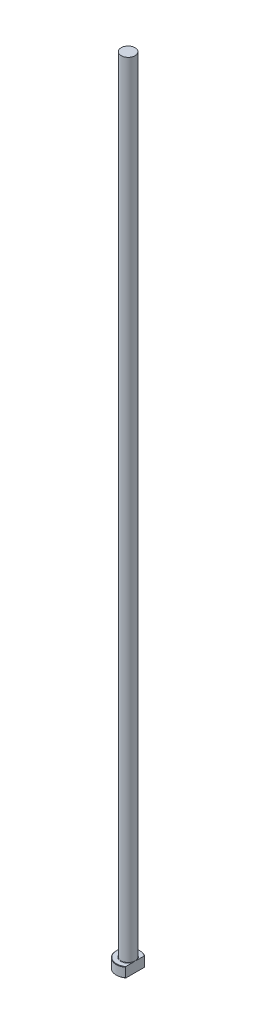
ISO-10303-21;
HEADER;
FILE_DESCRIPTION(('STEP AP214'),'2;1');
FILE_NAME('part.step','',(''),(''),'','','');
FILE_SCHEMA(('AUTOMOTIVE_DESIGN { 1 0 10303 214 1 1 1 1 }'));
ENDSEC;
DATA;
#1=APPLICATION_CONTEXT('core data for automotive mechanical design processes');
#2=APPLICATION_PROTOCOL_DEFINITION('international standard','automotive_design',2000,#1);
#3=PRODUCT_CONTEXT('',#1,'mechanical');
#4=PRODUCT('Part','Part','',(#3));
#5=PRODUCT_RELATED_PRODUCT_CATEGORY('part','',(#4));
#6=PRODUCT_DEFINITION_FORMATION('','',#4);
#7=PRODUCT_DEFINITION_CONTEXT('part definition',#1,'design');
#8=PRODUCT_DEFINITION('design','',#6,#7);
#9=PRODUCT_DEFINITION_SHAPE('','',#8);
#10=(LENGTH_UNIT() NAMED_UNIT(*) SI_UNIT(.MILLI.,.METRE.));
#11=(NAMED_UNIT(*) PLANE_ANGLE_UNIT() SI_UNIT($,.RADIAN.));
#12=(NAMED_UNIT(*) SI_UNIT($,.STERADIAN.) SOLID_ANGLE_UNIT());
#13=UNCERTAINTY_MEASURE_WITH_UNIT(LENGTH_MEASURE(1.E-05),#10,'distance_accuracy_value','');
#14=(GEOMETRIC_REPRESENTATION_CONTEXT(3) GLOBAL_UNCERTAINTY_ASSIGNED_CONTEXT((#13)) GLOBAL_UNIT_ASSIGNED_CONTEXT((#10,
#11,#12)) REPRESENTATION_CONTEXT('',''));
#15=CARTESIAN_POINT('',(0.,0.,0.));
#16=DIRECTION('',(0.,0.,1.));
#17=DIRECTION('',(1.,0.,0.));
#18=AXIS2_PLACEMENT_3D('',#15,#16,#17);
#19=CARTESIAN_POINT('',(0.,0.,0.));
#20=DIRECTION('',(0.,-1.,0.));
#21=DIRECTION('',(0.,0.,-1.));
#22=AXIS2_PLACEMENT_3D('',#19,#20,#21);
#23=PLANE('',#22);
#24=CARTESIAN_POINT('',(0.,0.,0.));
#25=DIRECTION('',(0.,-1.,0.));
#26=DIRECTION('',(0.,0.,-1.));
#27=AXIS2_PLACEMENT_3D('',#24,#25,#26);
#28=CIRCLE('',#27,5.79999999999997);
#29=CARTESIAN_POINT('',(3.49999999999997,0.,4.62493243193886));
#30=VERTEX_POINT('',#29);
#31=CARTESIAN_POINT('',(3.49999999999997,0.,-4.62493243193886));
#32=VERTEX_POINT('',#31);
#33=EDGE_CURVE('E98',#30,#32,#28,.T.);
#34=ORIENTED_EDGE('',*,*,#33,.T.);
#35=DIRECTION('',(0.,0.,1.));
#36=VECTOR('',#35,1.);
#37=CARTESIAN_POINT('',(3.49999999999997,0.,-4.87339717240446));
#38=LINE('',#37,#36);
#39=EDGE_CURVE('E83',#32,#30,#38,.T.);
#40=ORIENTED_EDGE('',*,*,#39,.T.);
#41=EDGE_LOOP('',(#34,#40));
#42=FACE_BOUND('',#41,.T.);
#43=ADVANCED_FACE('F32',(#42),#23,.T.);
#44=CARTESIAN_POINT('',(0.,259.958771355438,0.));
#45=DIRECTION('',(0.,1.,0.));
#46=DIRECTION('',(0.,0.,1.));
#47=AXIS2_PLACEMENT_3D('',#44,#45,#46);
#48=CYLINDRICAL_SURFACE('',#47,5.99999999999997);
#49=CARTESIAN_POINT('',(0.,4.80000000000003,0.));
#50=DIRECTION('',(0.,1.,0.));
#51=DIRECTION('',(0.,0.,1.));
#52=AXIS2_PLACEMENT_3D('',#49,#50,#51);
#53=CIRCLE('',#52,5.99999999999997);
#54=CARTESIAN_POINT('',(3.49999999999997,4.80000000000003,4.87339717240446));
#55=VERTEX_POINT('',#54);
#56=CARTESIAN_POINT('',(3.49999999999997,4.80000000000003,-4.87339717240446));
#57=VERTEX_POINT('',#56);
#58=EDGE_CURVE('E104',#55,#57,#53,.F.);
#59=ORIENTED_EDGE('',*,*,#58,.T.);
#60=DIRECTION('',(0.,-1.,0.));
#61=VECTOR('',#60,1.);
#62=CARTESIAN_POINT('',(3.49999999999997,400.,-4.87339717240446));
#63=LINE('',#62,#61);
#64=CARTESIAN_POINT('',(3.49999999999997,0.199999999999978,-4.87339717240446));
#65=VERTEX_POINT('',#64);
#66=EDGE_CURVE('E183',#57,#65,#63,.T.);
#67=ORIENTED_EDGE('',*,*,#66,.T.);
#68=CARTESIAN_POINT('',(0.,0.199999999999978,0.));
#69=DIRECTION('',(0.,-1.,0.));
#70=DIRECTION('',(0.,0.,-1.));
#71=AXIS2_PLACEMENT_3D('',#68,#69,#70);
#72=CIRCLE('',#71,5.99999999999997);
#73=CARTESIAN_POINT('',(3.49999999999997,0.199999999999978,4.87339717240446));
#74=VERTEX_POINT('',#73);
#75=EDGE_CURVE('E100',#65,#74,#72,.F.);
#76=ORIENTED_EDGE('',*,*,#75,.T.);
#77=DIRECTION('',(0.,-1.,0.));
#78=VECTOR('',#77,1.);
#79=CARTESIAN_POINT('',(3.49999999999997,400.,4.87339717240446));
#80=LINE('',#79,#78);
#81=EDGE_CURVE('E93',#55,#74,#80,.T.);
#82=ORIENTED_EDGE('',*,*,#81,.F.);
#83=EDGE_LOOP('',(#59,#67,#76,#82));
#84=FACE_BOUND('',#83,.T.);
#85=ADVANCED_FACE('F158',(#84),#48,.T.);
#86=CARTESIAN_POINT('',(-5.99999999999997,5.,0.));
#87=DIRECTION('',(0.,1.,0.));
#88=DIRECTION('',(0.,0.,1.));
#89=AXIS2_PLACEMENT_3D('',#86,#87,#88);
#90=PLANE('',#89);
#91=CARTESIAN_POINT('',(0.,5.,0.));
#92=DIRECTION('',(0.,1.,0.));
#93=DIRECTION('',(0.,0.,1.));
#94=AXIS2_PLACEMENT_3D('',#91,#92,#93);
#95=CIRCLE('',#94,5.79999999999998);
#96=CARTESIAN_POINT('',(3.49999999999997,5.,-4.62493243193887));
#97=VERTEX_POINT('',#96);
#98=CARTESIAN_POINT('',(3.49999999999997,5.,4.62493243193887));
#99=VERTEX_POINT('',#98);
#100=EDGE_CURVE('E178',#97,#99,#95,.T.);
#101=ORIENTED_EDGE('',*,*,#100,.T.);
#102=DIRECTION('',(0.,0.,-1.));
#103=VECTOR('',#102,1.);
#104=CARTESIAN_POINT('',(3.49999999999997,5.,0.));
#105=LINE('',#104,#103);
#106=CARTESIAN_POINT('',(3.49999999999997,4.99999999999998,1.19999999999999));
#107=VERTEX_POINT('',#106);
#108=EDGE_CURVE('E57',#99,#107,#105,.T.);
#109=ORIENTED_EDGE('',*,*,#108,.T.);
#110=CARTESIAN_POINT('',(0.,5.,0.));
#111=DIRECTION('',(0.,1.,0.));
#112=DIRECTION('',(0.,0.,1.));
#113=AXIS2_PLACEMENT_3D('',#110,#111,#112);
#114=CIRCLE('',#113,3.69999999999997);
#115=CARTESIAN_POINT('',(3.49999999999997,4.99999999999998,-1.19999999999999));
#116=VERTEX_POINT('',#115);
#117=EDGE_CURVE('E107',#107,#116,#114,.F.);
#118=ORIENTED_EDGE('',*,*,#117,.T.);
#119=EDGE_CURVE('E136',#116,#97,#105,.T.);
#120=ORIENTED_EDGE('',*,*,#119,.T.);
#121=EDGE_LOOP('',(#101,#109,#118,#120));
#122=FACE_BOUND('',#121,.T.);
#123=ADVANCED_FACE('F147',(#122),#90,.T.);
#124=CARTESIAN_POINT('',(0.,5.,0.));
#125=DIRECTION('',(0.,-1.,0.));
#126=DIRECTION('',(0.,0.,-1.));
#127=AXIS2_PLACEMENT_3D('',#124,#125,#126);
#128=CONICAL_SURFACE('',#127,5.79999999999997,0.785398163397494);
#129=ORIENTED_EDGE('',*,*,#58,.F.);
#130=CARTESIAN_POINT('',(3.49999999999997,-0.479658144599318,10.7229048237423));
#131=CARTESIAN_POINT('',(3.49999999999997,-0.304627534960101,10.5387821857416));
#132=CARTESIAN_POINT('',(3.49999999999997,-0.12982047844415,10.3544468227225));
#133=CARTESIAN_POINT('',(3.49999999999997,0.219261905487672,9.98527122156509));
#134=CARTESIAN_POINT('',(3.49999999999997,0.39353722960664,9.80043098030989));
#135=CARTESIAN_POINT('',(3.49999999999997,0.91559488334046,9.24486752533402));
#136=CARTESIAN_POINT('',(3.49999999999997,1.26244829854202,8.87327020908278));
#137=CARTESIAN_POINT('',(3.49999999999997,1.95718621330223,8.12195979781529));
#138=CARTESIAN_POINT('',(3.49999999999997,2.30502483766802,7.74220412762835));
#139=CARTESIAN_POINT('',(3.49999999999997,2.82267860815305,7.16898192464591));
#140=CARTESIAN_POINT('',(3.49999999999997,2.99451670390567,6.97734293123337));
#141=CARTESIAN_POINT('',(3.49999999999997,3.33649221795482,6.59255347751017));
#142=CARTESIAN_POINT('',(3.49999999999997,3.50662964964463,6.39940302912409));
#143=CARTESIAN_POINT('',(3.49999999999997,3.80984794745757,6.05127590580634));
#144=CARTESIAN_POINT('',(3.49999999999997,3.9433293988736,5.89664839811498));
#145=CARTESIAN_POINT('',(3.49999999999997,4.20861192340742,5.58595941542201));
#146=CARTESIAN_POINT('',(3.49999999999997,4.34041301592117,5.42989795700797));
#147=CARTESIAN_POINT('',(3.49999999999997,4.60204886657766,5.11587234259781));
#148=CARTESIAN_POINT('',(3.49999999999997,4.73188156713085,4.9579064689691));
#149=CARTESIAN_POINT('',(3.49999999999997,4.98887681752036,4.63982145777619));
#150=CARTESIAN_POINT('',(3.49999999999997,5.11603946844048,4.47970240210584));
#151=CARTESIAN_POINT('',(3.49999999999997,5.36664013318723,4.15712646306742));
#152=CARTESIAN_POINT('',(3.49999999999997,5.49008567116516,3.99467544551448));
#153=CARTESIAN_POINT('',(3.49999999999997,5.73245687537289,3.6663703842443));
#154=CARTESIAN_POINT('',(3.49999999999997,5.85138169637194,3.50051571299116));
#155=CARTESIAN_POINT('',(3.49999999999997,6.08288587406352,3.16479623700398));
#156=CARTESIAN_POINT('',(3.49999999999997,6.19547497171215,2.99493819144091));
#157=CARTESIAN_POINT('',(3.49999999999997,6.41208556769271,2.6498795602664));
#158=CARTESIAN_POINT('',(3.49999999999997,6.51611116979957,2.47468158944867));
#159=CARTESIAN_POINT('',(3.49999999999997,6.68667355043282,2.16371702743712));
#160=CARTESIAN_POINT('',(3.49999999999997,6.75595020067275,2.02946380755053));
#161=CARTESIAN_POINT('',(3.49999999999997,6.88572771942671,1.75668071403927));
#162=CARTESIAN_POINT('',(3.49999999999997,6.9462264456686,1.61814980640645));
#163=CARTESIAN_POINT('',(3.49999999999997,7.05535730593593,1.33751093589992));
#164=CARTESIAN_POINT('',(3.49999999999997,7.10406788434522,1.1954339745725));
#165=CARTESIAN_POINT('',(3.49999999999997,7.18698872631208,0.907101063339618));
#166=CARTESIAN_POINT('',(3.49999999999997,7.22121012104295,0.760848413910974));
#167=CARTESIAN_POINT('',(3.49999999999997,7.26487302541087,0.507831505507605));
#168=CARTESIAN_POINT('',(3.49999999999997,7.27861043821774,0.401805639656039));
#169=CARTESIAN_POINT('',(3.49999999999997,7.29650595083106,0.188947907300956));
#170=CARTESIAN_POINT('',(3.49999999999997,7.30066582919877,0.0821161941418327));
#171=CARTESIAN_POINT('',(3.49999999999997,7.29916002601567,-0.131492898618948));
#172=CARTESIAN_POINT('',(3.49999999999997,7.29349282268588,-0.238270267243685));
#173=CARTESIAN_POINT('',(3.49999999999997,7.27266406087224,-0.450895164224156));
#174=CARTESIAN_POINT('',(3.49999999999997,7.25750065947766,-0.556742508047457));
#175=CARTESIAN_POINT('',(3.49999999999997,7.21256554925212,-0.79858965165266));
#176=CARTESIAN_POINT('',(3.49999999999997,7.17976248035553,-0.934025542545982));
#177=CARTESIAN_POINT('',(3.49999999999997,7.10180151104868,-1.20127435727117));
#178=CARTESIAN_POINT('',(3.49999999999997,7.05663717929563,-1.33308535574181));
#179=CARTESIAN_POINT('',(3.49999999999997,6.95617548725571,-1.59358719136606));
#180=CARTESIAN_POINT('',(3.49999999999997,6.90082290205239,-1.72225647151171));
#181=CARTESIAN_POINT('',(3.49999999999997,6.81196782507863,-1.91246868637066));
#182=CARTESIAN_POINT('',(3.49999999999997,6.78138093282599,-1.97540288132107));
#183=CARTESIAN_POINT('',(3.49999999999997,6.71848328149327,-2.10040375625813));
#184=CARTESIAN_POINT('',(3.49999999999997,6.68617255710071,-2.16247045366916));
#185=CARTESIAN_POINT('',(3.49999999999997,6.59348343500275,-2.33529342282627));
#186=CARTESIAN_POINT('',(3.49999999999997,6.53139715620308,-2.44513435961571));
#187=CARTESIAN_POINT('',(3.49999999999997,6.40327495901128,-2.66249790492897));
#188=CARTESIAN_POINT('',(3.49999999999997,6.33723828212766,-2.77002006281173));
#189=CARTESIAN_POINT('',(3.49999999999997,6.20193961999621,-2.98310926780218));
#190=CARTESIAN_POINT('',(3.49999999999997,6.13267551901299,-3.08867496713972));
#191=CARTESIAN_POINT('',(3.49999999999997,5.99154722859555,-3.29805772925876));
#192=CARTESIAN_POINT('',(3.49999999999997,5.91968285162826,-3.40187466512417));
#193=CARTESIAN_POINT('',(3.49999999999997,5.70053198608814,-3.71160333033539));
#194=CARTESIAN_POINT('',(3.49999999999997,5.55004115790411,-3.91524708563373));
#195=CARTESIAN_POINT('',(3.49999999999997,5.24323373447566,-4.31793623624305));
#196=CARTESIAN_POINT('',(3.49999999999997,5.08691924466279,-4.5169832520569));
#197=CARTESIAN_POINT('',(3.49999999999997,4.76917008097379,-4.91272714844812));
#198=CARTESIAN_POINT('',(3.49999999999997,4.60771212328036,-5.10940527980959));
#199=CARTESIAN_POINT('',(3.49999999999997,4.28159454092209,-5.50010578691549));
#200=CARTESIAN_POINT('',(3.49999999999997,4.11693466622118,-5.69412795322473));
#201=CARTESIAN_POINT('',(3.49999999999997,3.7854437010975,-6.07977702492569));
#202=CARTESIAN_POINT('',(3.49999999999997,3.61861641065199,-6.27140720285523));
#203=CARTESIAN_POINT('',(3.49999999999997,3.28306967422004,-6.65300504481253));
#204=CARTESIAN_POINT('',(3.49999999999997,3.11435020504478,-6.84297268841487));
#205=CARTESIAN_POINT('',(3.49999999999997,2.66324311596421,-7.3468737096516));
#206=CARTESIAN_POINT('',(3.49999999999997,2.37954008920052,-7.65962881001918));
#207=CARTESIAN_POINT('',(3.49999999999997,1.80910784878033,-8.28261634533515));
#208=CARTESIAN_POINT('',(3.49999999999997,1.52237733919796,-8.59284759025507));
#209=CARTESIAN_POINT('',(3.49999999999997,0.950562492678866,-9.20727688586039));
#210=CARTESIAN_POINT('',(3.49999999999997,0.665505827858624,-9.51150072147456));
#211=CARTESIAN_POINT('',(3.49999999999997,0.0939335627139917,-10.1182972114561));
#212=CARTESIAN_POINT('',(3.49999999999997,-0.192581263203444,-10.4208705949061));
#213=CARTESIAN_POINT('',(3.49999999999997,-0.479658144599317,-10.7229048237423));
#214=B_SPLINE_CURVE_WITH_KNOTS('',3,(#130,#131,#132,#133,#134,#135,#136,#137,#138,#139,#140,
#141,#142,#143,#144,#145,#146,#147,#148,#149,#150,#151,#152,#153,#154,#155,#156,#157,#158,#159,
#160,#161,#162,#163,#164,#165,#166,#167,#168,#169,#170,#171,#172,#173,#174,#175,#176,#177,#178,
#179,#180,#181,#182,#183,#184,#185,#186,#187,#188,#189,#190,#191,#192,#193,#194,#195,#196,#197,
#198,#199,#200,#201,#202,#203,#204,#205,#206,#207,#208,#209,#210,#211,#212,#213),.UNSPECIFIED.,
.F.,.F.,(4,2,2,2,2,2,2,2,2,2,2,2,2,2,2,2,2,2,2,2,2,2,2,2,2,2,2,2,2,2,2,2,2,2,2,2,2,2,2,2,2,4),
(0.,0.762123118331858,1.52425095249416,3.04920520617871,4.59410962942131,5.36629689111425,
6.13847806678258,6.75128402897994,7.36408291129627,7.97748343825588,8.59086070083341,
9.20289910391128,9.81505138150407,10.4262352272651,11.0371244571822,11.4901076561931,
11.94320122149,12.393191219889,12.842834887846,13.1631796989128,13.4834650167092,
13.8037999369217,14.1241970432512,14.5415079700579,14.9590364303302,15.3788985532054,
15.5887982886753,15.7986938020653,16.1771020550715,16.5555831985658,16.9343160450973,
17.3130762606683,18.0725457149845,18.8317432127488,19.5950831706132,20.3584829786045,
21.1206884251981,21.88290322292,23.1496528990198,24.4169687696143,25.6676760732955,
26.9177769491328),.UNSPECIFIED.);
#215=EDGE_CURVE('E135',#55,#99,#214,.T.);
#216=ORIENTED_EDGE('',*,*,#215,.T.);
#217=ORIENTED_EDGE('',*,*,#100,.F.);
#218=EDGE_CURVE('E127',#97,#57,#214,.T.);
#219=ORIENTED_EDGE('',*,*,#218,.T.);
#220=EDGE_LOOP('',(#129,#216,#217,#219));
#221=FACE_BOUND('',#220,.T.);
#222=ADVANCED_FACE('F143',(#221),#128,.T.);
#223=CARTESIAN_POINT('',(0.,0.199999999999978,0.));
#224=DIRECTION('',(0.,1.,0.));
#225=DIRECTION('',(0.,0.,1.));
#226=AXIS2_PLACEMENT_3D('',#223,#224,#225);
#227=CONICAL_SURFACE('',#226,5.99999999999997,0.785398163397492);
#228=ORIENTED_EDGE('',*,*,#75,.F.);
#229=CARTESIAN_POINT('',(3.49999999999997,5.47965814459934,-10.7229048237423));
#230=CARTESIAN_POINT('',(3.49999999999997,5.30462753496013,-10.5387821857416));
#231=CARTESIAN_POINT('',(3.49999999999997,5.12982047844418,-10.3544468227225));
#232=CARTESIAN_POINT('',(3.49999999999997,4.78073809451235,-9.98527122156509));
#233=CARTESIAN_POINT('',(3.49999999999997,4.60646277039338,-9.80043098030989));
#234=CARTESIAN_POINT('',(3.49999999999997,4.08440511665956,-9.24486752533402));
#235=CARTESIAN_POINT('',(3.49999999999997,3.737551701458,-8.87327020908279));
#236=CARTESIAN_POINT('',(3.49999999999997,3.04281378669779,-8.12195979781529));
#237=CARTESIAN_POINT('',(3.49999999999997,2.694975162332,-7.74220412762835));
#238=CARTESIAN_POINT('',(3.49999999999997,2.17732139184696,-7.16898192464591));
#239=CARTESIAN_POINT('',(3.49999999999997,2.00548329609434,-6.97734293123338));
#240=CARTESIAN_POINT('',(3.49999999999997,1.6635077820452,-6.59255347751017));
#241=CARTESIAN_POINT('',(3.49999999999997,1.49337035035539,-6.3994030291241));
#242=CARTESIAN_POINT('',(3.49999999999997,1.19015205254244,-6.05127590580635));
#243=CARTESIAN_POINT('',(3.49999999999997,1.05667060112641,-5.89664839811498));
#244=CARTESIAN_POINT('',(3.49999999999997,0.791388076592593,-5.58595941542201));
#245=CARTESIAN_POINT('',(3.49999999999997,0.659586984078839,-5.42989795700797));
#246=CARTESIAN_POINT('',(3.49999999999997,0.397951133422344,-5.11587234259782));
#247=CARTESIAN_POINT('',(3.49999999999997,0.26811843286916,-4.95790646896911));
#248=CARTESIAN_POINT('',(3.49999999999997,0.0111231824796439,-4.63982145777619));
#249=CARTESIAN_POINT('',(3.49999999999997,-0.116039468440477,-4.47970240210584));
#250=CARTESIAN_POINT('',(3.49999999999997,-0.366640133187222,-4.15712646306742));
#251=CARTESIAN_POINT('',(3.49999999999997,-0.490085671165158,-3.99467544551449));
#252=CARTESIAN_POINT('',(3.49999999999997,-0.732456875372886,-3.6663703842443));
#253=CARTESIAN_POINT('',(3.49999999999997,-0.851381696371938,-3.50051571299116));
#254=CARTESIAN_POINT('',(3.49999999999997,-1.08288587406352,-3.16479623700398));
#255=CARTESIAN_POINT('',(3.49999999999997,-1.19547497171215,-2.99493819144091));
#256=CARTESIAN_POINT('',(3.49999999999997,-1.41208556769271,-2.6498795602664));
#257=CARTESIAN_POINT('',(3.49999999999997,-1.51611116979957,-2.47468158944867));
#258=CARTESIAN_POINT('',(3.49999999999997,-1.68667355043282,-2.16371702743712));
#259=CARTESIAN_POINT('',(3.49999999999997,-1.75595020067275,-2.02946380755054));
#260=CARTESIAN_POINT('',(3.49999999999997,-1.88572771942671,-1.75668071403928));
#261=CARTESIAN_POINT('',(3.49999999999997,-1.9462264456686,-1.61814980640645));
#262=CARTESIAN_POINT('',(3.49999999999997,-2.05535730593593,-1.33751093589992));
#263=CARTESIAN_POINT('',(3.49999999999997,-2.10406788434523,-1.1954339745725));
#264=CARTESIAN_POINT('',(3.49999999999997,-2.18698872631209,-0.907101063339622));
#265=CARTESIAN_POINT('',(3.49999999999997,-2.22121012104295,-0.760848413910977));
#266=CARTESIAN_POINT('',(3.49999999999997,-2.26487302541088,-0.507831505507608));
#267=CARTESIAN_POINT('',(3.49999999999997,-2.27861043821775,-0.401805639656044));
#268=CARTESIAN_POINT('',(3.49999999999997,-2.29650595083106,-0.188947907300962));
#269=CARTESIAN_POINT('',(3.49999999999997,-2.30066582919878,-0.0821161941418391));
#270=CARTESIAN_POINT('',(3.49999999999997,-2.29916002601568,0.131492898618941));
#271=CARTESIAN_POINT('',(3.49999999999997,-2.29349282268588,0.238270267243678));
#272=CARTESIAN_POINT('',(3.49999999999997,-2.27266406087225,0.450895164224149));
#273=CARTESIAN_POINT('',(3.49999999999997,-2.25750065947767,0.556742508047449));
#274=CARTESIAN_POINT('',(3.49999999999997,-2.21256554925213,0.79858965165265));
#275=CARTESIAN_POINT('',(3.49999999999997,-2.17976248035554,0.934025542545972));
#276=CARTESIAN_POINT('',(3.49999999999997,-2.10180151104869,1.20127435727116));
#277=CARTESIAN_POINT('',(3.49999999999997,-2.05663717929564,1.3330853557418));
#278=CARTESIAN_POINT('',(3.49999999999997,-1.95617548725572,1.59358719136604));
#279=CARTESIAN_POINT('',(3.49999999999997,-1.9008229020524,1.7222564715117));
#280=CARTESIAN_POINT('',(3.49999999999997,-1.81196782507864,1.91246868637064));
#281=CARTESIAN_POINT('',(3.49999999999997,-1.781380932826,1.97540288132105));
#282=CARTESIAN_POINT('',(3.49999999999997,-1.71848328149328,2.10040375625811));
#283=CARTESIAN_POINT('',(3.49999999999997,-1.68617255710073,2.16247045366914));
#284=CARTESIAN_POINT('',(3.49999999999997,-1.59348343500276,2.33529342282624));
#285=CARTESIAN_POINT('',(3.49999999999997,-1.5313971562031,2.44513435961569));
#286=CARTESIAN_POINT('',(3.49999999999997,-1.4032749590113,2.66249790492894));
#287=CARTESIAN_POINT('',(3.49999999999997,-1.33723828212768,2.7700200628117));
#288=CARTESIAN_POINT('',(3.49999999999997,-1.20193961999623,2.98310926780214));
#289=CARTESIAN_POINT('',(3.49999999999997,-1.13267551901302,3.08867496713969));
#290=CARTESIAN_POINT('',(3.49999999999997,-0.991547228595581,3.29805772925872));
#291=CARTESIAN_POINT('',(3.49999999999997,-0.919682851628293,3.40187466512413));
#292=CARTESIAN_POINT('',(3.49999999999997,-0.700531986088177,3.71160333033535));
#293=CARTESIAN_POINT('',(3.49999999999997,-0.550041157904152,3.91524708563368));
#294=CARTESIAN_POINT('',(3.49999999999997,-0.243233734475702,4.31793623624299));
#295=CARTESIAN_POINT('',(3.49999999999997,-0.0869192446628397,4.51698325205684));
#296=CARTESIAN_POINT('',(3.49999999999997,0.23082991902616,4.91272714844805));
#297=CARTESIAN_POINT('',(3.49999999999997,0.392287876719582,5.10940527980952));
#298=CARTESIAN_POINT('',(3.49999999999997,0.71840545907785,5.50010578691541));
#299=CARTESIAN_POINT('',(3.49999999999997,0.883065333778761,5.69412795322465));
#300=CARTESIAN_POINT('',(3.49999999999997,1.21455629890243,6.0797770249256));
#301=CARTESIAN_POINT('',(3.49999999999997,1.38138358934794,6.27140720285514));
#302=CARTESIAN_POINT('',(3.49999999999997,1.71693032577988,6.65300504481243));
#303=CARTESIAN_POINT('',(3.49999999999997,1.88564979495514,6.84297268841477));
#304=CARTESIAN_POINT('',(3.49999999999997,2.33675688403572,7.3468737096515));
#305=CARTESIAN_POINT('',(3.49999999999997,2.62045991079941,7.6596288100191));
#306=CARTESIAN_POINT('',(3.49999999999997,3.19089215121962,8.28261634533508));
#307=CARTESIAN_POINT('',(3.49999999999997,3.477622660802,8.59284759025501));
#308=CARTESIAN_POINT('',(3.49999999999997,4.04943750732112,9.20727688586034));
#309=CARTESIAN_POINT('',(3.49999999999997,4.33449417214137,9.51150072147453));
#310=CARTESIAN_POINT('',(3.49999999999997,4.90606643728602,10.118297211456));
#311=CARTESIAN_POINT('',(3.49999999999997,5.19258126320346,10.4208705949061));
#312=CARTESIAN_POINT('',(3.49999999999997,5.47965814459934,10.7229048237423));
#313=B_SPLINE_CURVE_WITH_KNOTS('',3,(#229,#230,#231,#232,#233,#234,#235,#236,#237,#238,#239,
#240,#241,#242,#243,#244,#245,#246,#247,#248,#249,#250,#251,#252,#253,#254,#255,#256,#257,#258,
#259,#260,#261,#262,#263,#264,#265,#266,#267,#268,#269,#270,#271,#272,#273,#274,#275,#276,#277,
#278,#279,#280,#281,#282,#283,#284,#285,#286,#287,#288,#289,#290,#291,#292,#293,#294,#295,#296,
#297,#298,#299,#300,#301,#302,#303,#304,#305,#306,#307,#308,#309,#310,#311,#312),.UNSPECIFIED.,
.F.,.F.,(4,2,2,2,2,2,2,2,2,2,2,2,2,2,2,2,2,2,2,2,2,2,2,2,2,2,2,2,2,2,2,2,2,2,2,2,2,2,2,2,2,4),
(0.,0.762123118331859,1.52425095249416,3.04920520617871,4.59410962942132,5.36629689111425,
6.13847806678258,6.75128402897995,7.36408291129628,7.97748343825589,8.59086070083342,
9.20289910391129,9.81505138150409,10.4262352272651,11.0371244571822,11.4901076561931,
11.94320122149,12.393191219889,12.842834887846,13.1631796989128,13.4834650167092,
13.8037999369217,14.1241970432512,14.5415079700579,14.9590364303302,15.3788985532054,
15.5887982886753,15.7986938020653,16.1771020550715,16.5555831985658,16.9343160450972,
17.3130762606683,18.0725457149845,18.8317432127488,19.5950831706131,20.3584829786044,
21.120688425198,21.8829032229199,23.1496528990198,24.4169687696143,25.6676760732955,
26.9177769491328),.UNSPECIFIED.);
#314=EDGE_CURVE('E86',#65,#32,#313,.T.);
#315=ORIENTED_EDGE('',*,*,#314,.T.);
#316=ORIENTED_EDGE('',*,*,#33,.F.);
#317=EDGE_CURVE('E89',#30,#74,#313,.T.);
#318=ORIENTED_EDGE('',*,*,#317,.T.);
#319=EDGE_LOOP('',(#228,#315,#316,#318));
#320=FACE_BOUND('',#319,.T.);
#321=ADVANCED_FACE('F97',(#320),#227,.T.);
#322=CARTESIAN_POINT('',(0.,5.19999999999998,0.));
#323=DIRECTION('',(0.,1.,0.));
#324=DIRECTION('',(0.,0.,1.));
#325=AXIS2_PLACEMENT_3D('',#322,#323,#324);
#326=TOROIDAL_SURFACE('',#325,3.69999999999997,0.2);
#327=CARTESIAN_POINT('',(3.49999999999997,5.19999999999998,0.));
#328=CARTESIAN_POINT('',(3.49999999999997,5.20000050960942,9.98094828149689E-11));
#329=CARTESIAN_POINT('',(3.49999999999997,5.20000101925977,-2.13486746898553E-07));
#330=CARTESIAN_POINT('',(3.49999999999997,5.20000196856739,-7.957591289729E-07));
#331=CARTESIAN_POINT('',(3.49999999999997,5.20000239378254,-1.17925839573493E-06));
#332=CARTESIAN_POINT('',(3.49999999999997,5.20000328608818,-2.10014972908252E-06));
#333=CARTESIAN_POINT('',(3.49999999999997,5.20000373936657,-2.65249908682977E-06));
#334=CARTESIAN_POINT('',(3.49999999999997,5.20000454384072,-3.79112889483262E-06));
#335=CARTESIAN_POINT('',(3.49999999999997,5.20000489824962,-4.37533521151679E-06));
#336=CARTESIAN_POINT('',(3.49999999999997,5.20000623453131,-6.66270059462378E-06));
#337=CARTESIAN_POINT('',(3.49999999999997,5.20000714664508,-8.40961025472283E-06));
#338=CARTESIAN_POINT('',(3.49999999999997,5.20000862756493,-1.18496824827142E-05));
#339=CARTESIAN_POINT('',(3.49999999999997,5.20000922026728,-1.35329548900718E-05));
#340=CARTESIAN_POINT('',(3.49999999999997,5.20001174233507,-2.07268950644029E-05));
#341=CARTESIAN_POINT('',(3.49999999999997,5.20001365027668,-2.62477536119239E-05));
#342=CARTESIAN_POINT('',(3.49999999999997,5.20001642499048,-3.66274572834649E-05));
#343=CARTESIAN_POINT('',(3.49999999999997,5.20001740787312,-4.14549355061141E-05));
#344=CARTESIAN_POINT('',(3.49999999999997,5.20002462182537,-7.75352102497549E-05));
#345=CARTESIAN_POINT('',(3.49999999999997,5.20003014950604,-0.000108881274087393));
#346=CARTESIAN_POINT('',(3.49999999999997,5.20005434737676,-0.000233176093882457));
#347=CARTESIAN_POINT('',(3.49999999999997,5.20007737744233,-0.000325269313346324));
#348=CARTESIAN_POINT('',(3.49999999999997,5.20016742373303,-0.000691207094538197));
#349=CARTESIAN_POINT('',(3.49999999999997,5.20023166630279,-0.000965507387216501));
#350=CARTESIAN_POINT('',(3.49999999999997,5.20048971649,-0.0020594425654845));
#351=CARTESIAN_POINT('',(3.49999999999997,5.20068705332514,-0.00287847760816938));
#352=CARTESIAN_POINT('',(3.49999999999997,5.20150941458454,-0.00630050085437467));
#353=CARTESIAN_POINT('',(3.49999999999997,5.20212997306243,-0.00890424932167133));
#354=CARTESIAN_POINT('',(3.49999999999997,5.20703918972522,-0.0294912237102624));
#355=CARTESIAN_POINT('',(3.49999999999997,5.21134300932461,-0.0474719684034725));
#356=CARTESIAN_POINT('',(3.49999999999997,5.21975360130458,-0.0827191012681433));
#357=CARTESIAN_POINT('',(3.49999999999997,5.22386136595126,-0.0999852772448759));
#358=CARTESIAN_POINT('',(3.49999999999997,5.2372401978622,-0.156405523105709));
#359=CARTESIAN_POINT('',(3.49999999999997,5.24645854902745,-0.195572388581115));
#360=CARTESIAN_POINT('',(3.49999999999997,5.26203234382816,-0.262828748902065));
#361=CARTESIAN_POINT('',(3.49999999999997,5.26845671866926,-0.290902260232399));
#362=CARTESIAN_POINT('',(3.49999999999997,5.28094671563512,-0.346379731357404));
#363=CARTESIAN_POINT('',(3.49999999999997,5.28701730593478,-0.373782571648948));
#364=CARTESIAN_POINT('',(3.49999999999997,5.30077691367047,-0.437211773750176));
#365=CARTESIAN_POINT('',(3.49999999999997,5.3083789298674,-0.473257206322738));
#366=CARTESIAN_POINT('',(3.49999999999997,5.32309409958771,-0.545736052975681));
#367=CARTESIAN_POINT('',(3.49999999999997,5.33020304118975,-0.582170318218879));
#368=CARTESIAN_POINT('',(3.49999999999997,5.35161649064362,-0.697757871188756));
#369=CARTESIAN_POINT('',(3.49999999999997,5.36463967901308,-0.777158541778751));
#370=CARTESIAN_POINT('',(3.49999999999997,5.3843837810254,-0.92756184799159));
#371=CARTESIAN_POINT('',(3.49999999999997,5.39165512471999,-0.998486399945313));
#372=CARTESIAN_POINT('',(3.49999999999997,5.3979989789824,-1.10437287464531));
#373=CARTESIAN_POINT('',(3.49999999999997,5.39936233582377,-1.13919451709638));
#374=CARTESIAN_POINT('',(3.49999999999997,5.40028946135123,-1.20885098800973));
#375=CARTESIAN_POINT('',(3.49999999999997,5.39985418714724,-1.24368579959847));
#376=CARTESIAN_POINT('',(3.49999999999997,5.39686573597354,-1.30963279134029));
#377=CARTESIAN_POINT('',(3.49999999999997,5.39453835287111,-1.34075403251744));
#378=CARTESIAN_POINT('',(3.49999999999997,5.38750048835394,-1.40298456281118));
#379=CARTESIAN_POINT('',(3.49999999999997,5.38277118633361,-1.43409178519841));
#380=CARTESIAN_POINT('',(3.49999999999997,5.37000596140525,-1.49609278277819));
#381=CARTESIAN_POINT('',(3.49999999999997,5.36193044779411,-1.52697933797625));
#382=CARTESIAN_POINT('',(3.49999999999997,5.34614337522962,-1.57192957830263));
#383=CARTESIAN_POINT('',(3.49999999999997,5.3402919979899,-1.5866404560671));
#384=CARTESIAN_POINT('',(3.49999999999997,5.32701491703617,-1.6153215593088));
#385=CARTESIAN_POINT('',(3.49999999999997,5.31959341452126,-1.6292936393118));
#386=CARTESIAN_POINT('',(3.49999999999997,5.30547056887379,-1.65150372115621));
#387=CARTESIAN_POINT('',(3.49999999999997,5.29934759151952,-1.6601058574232));
#388=CARTESIAN_POINT('',(3.49999999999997,5.28595656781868,-1.67637400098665));
#389=CARTESIAN_POINT('',(3.49999999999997,5.27869146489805,-1.68404232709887));
#390=CARTESIAN_POINT('',(3.49999999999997,5.26587375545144,-1.69518467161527));
#391=CARTESIAN_POINT('',(3.49999999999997,5.26073958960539,-1.69913647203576));
#392=CARTESIAN_POINT('',(3.49999999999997,5.24994100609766,-1.70624293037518));
#393=CARTESIAN_POINT('',(3.49999999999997,5.24427723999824,-1.70939855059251));
#394=CARTESIAN_POINT('',(3.49999999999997,5.23351378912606,-1.71418736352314));
#395=CARTESIAN_POINT('',(3.49999999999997,5.22849079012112,-1.71599090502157));
#396=CARTESIAN_POINT('',(3.49999999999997,5.21821361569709,-1.71873268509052));
#397=CARTESIAN_POINT('',(3.49999999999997,5.21295968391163,-1.71967181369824));
#398=CARTESIAN_POINT('',(3.49999999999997,5.20234462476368,-1.72059432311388));
#399=CARTESIAN_POINT('',(3.49999999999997,5.19698314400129,-1.72057373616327));
#400=CARTESIAN_POINT('',(3.49999999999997,5.18635093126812,-1.71956893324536));
#401=CARTESIAN_POINT('',(3.49999999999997,5.18108024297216,-1.71858426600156));
#402=CARTESIAN_POINT('',(3.49999999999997,5.17106869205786,-1.71582968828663));
#403=CARTESIAN_POINT('',(3.49999999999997,5.16631466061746,-1.71410641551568));
#404=CARTESIAN_POINT('',(3.49999999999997,5.15709718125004,-1.71001459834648));
#405=CARTESIAN_POINT('',(3.49999999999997,5.15263381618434,-1.70764587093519));
#406=CARTESIAN_POINT('',(3.49999999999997,5.14110717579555,-1.70060771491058));
#407=CARTESIAN_POINT('',(3.49999999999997,5.13433222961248,-1.69546710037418));
#408=CARTESIAN_POINT('',(3.49999999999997,5.12164557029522,-1.68420869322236));
#409=CARTESIAN_POINT('',(3.49999999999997,5.11573697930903,-1.67808752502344));
#410=CARTESIAN_POINT('',(3.49999999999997,5.10028952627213,-1.66008531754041));
#411=CARTESIAN_POINT('',(3.49999999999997,5.09159238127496,-1.64748936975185));
#412=CARTESIAN_POINT('',(3.49999999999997,5.07604019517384,-1.62125022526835));
#413=CARTESIAN_POINT('',(3.49999999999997,5.06918749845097,-1.60760572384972));
#414=CARTESIAN_POINT('',(3.49999999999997,5.05635908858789,-1.57851190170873));
#415=CARTESIAN_POINT('',(3.49999999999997,5.05050870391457,-1.56300807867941));
#416=CARTESIAN_POINT('',(3.49999999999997,5.04009412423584,-1.53156759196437));
#417=CARTESIAN_POINT('',(3.49999999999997,5.03553147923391,-1.51563043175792));
#418=CARTESIAN_POINT('',(3.49999999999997,5.02331191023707,-1.46712048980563));
#419=CARTESIAN_POINT('',(3.49999999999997,5.01724153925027,-1.4341495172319));
#420=CARTESIAN_POINT('',(3.49999999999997,5.00883071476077,-1.37348993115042));
#421=CARTESIAN_POINT('',(3.49999999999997,5.00603148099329,-1.34585663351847));
#422=CARTESIAN_POINT('',(3.49999999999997,5.00204762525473,-1.29046925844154));
#423=CARTESIAN_POINT('',(3.49999999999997,5.00086336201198,-1.26271515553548));
#424=CARTESIAN_POINT('',(3.49999999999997,4.99925913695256,-1.17922229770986));
#425=CARTESIAN_POINT('',(3.49999999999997,5.00080993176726,-1.1234488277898));
#426=CARTESIAN_POINT('',(3.49999999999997,5.00738569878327,-1.01528124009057));
#427=CARTESIAN_POINT('',(3.49999999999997,5.01221131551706,-0.962872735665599));
#428=CARTESIAN_POINT('',(3.49999999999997,5.02425367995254,-0.858750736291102));
#429=CARTESIAN_POINT('',(3.49999999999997,5.03145152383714,-0.807035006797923));
#430=CARTESIAN_POINT('',(3.49999999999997,5.04786442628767,-0.702500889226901));
#431=CARTESIAN_POINT('',(3.49999999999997,5.05712869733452,-0.649690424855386));
#432=CARTESIAN_POINT('',(3.49999999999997,5.07730630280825,-0.542969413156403));
#433=CARTESIAN_POINT('',(3.49999999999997,5.08825618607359,-0.489065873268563));
#434=CARTESIAN_POINT('',(3.49999999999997,5.10770336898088,-0.397738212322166));
#435=CARTESIAN_POINT('',(3.49999999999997,5.11594150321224,-0.360258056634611));
#436=CARTESIAN_POINT('',(3.49999999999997,5.1326812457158,-0.285797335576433));
#437=CARTESIAN_POINT('',(3.49999999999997,5.14117887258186,-0.248815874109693));
#438=CARTESIAN_POINT('',(3.49999999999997,5.15740628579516,-0.179140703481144));
#439=CARTESIAN_POINT('',(3.49999999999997,5.16511243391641,-0.146441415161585));
#440=CARTESIAN_POINT('',(3.49999999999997,5.18096853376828,-0.0796648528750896));
#441=CARTESIAN_POINT('',(3.49999999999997,5.18912333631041,-0.045588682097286));
#442=CARTESIAN_POINT('',(3.49999999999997,5.19787118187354,-0.00889903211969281));
#443=CARTESIAN_POINT('',(3.49999999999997,5.19849305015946,-0.00629009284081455));
#444=CARTESIAN_POINT('',(3.49999999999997,5.19931571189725,-0.00286690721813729));
#445=CARTESIAN_POINT('',(3.49999999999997,5.19951207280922,-0.0020519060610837));
#446=CARTESIAN_POINT('',(3.49999999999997,5.19976893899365,-0.0009629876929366));
#447=CARTESIAN_POINT('',(3.49999999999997,5.19983295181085,-0.00068966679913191));
#448=CARTESIAN_POINT('',(3.49999999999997,5.19992272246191,-0.000324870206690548));
#449=CARTESIAN_POINT('',(3.49999999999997,5.19994571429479,-0.000232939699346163));
#450=CARTESIAN_POINT('',(3.49999999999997,5.19996987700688,-0.000108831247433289));
#451=CARTESIAN_POINT('',(3.49999999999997,5.19997540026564,-7.75074375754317E-05));
#452=CARTESIAN_POINT('',(3.49999999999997,5.19998260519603,-4.1449950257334E-05));
#453=CARTESIAN_POINT('',(3.49999999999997,5.19998358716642,-3.66236562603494E-05));
#454=CARTESIAN_POINT('',(3.49999999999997,5.19998635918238,-2.62464271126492E-05));
#455=CARTESIAN_POINT('',(3.49999999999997,5.19998826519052,-2.07267962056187E-05));
#456=CARTESIAN_POINT('',(3.49999999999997,5.19999078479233,-1.353414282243E-05));
#457=CARTESIAN_POINT('',(3.49999999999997,5.19999137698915,-1.18509583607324E-05));
#458=CARTESIAN_POINT('',(3.49999999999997,5.19999285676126,-8.4109834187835E-06));
#459=CARTESIAN_POINT('',(3.49999999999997,5.19999376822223,-6.66407126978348E-06));
#460=CARTESIAN_POINT('',(3.49999999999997,5.19999510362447,-4.37661194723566E-06));
#461=CARTESIAN_POINT('',(3.49999999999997,5.19999545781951,-3.79235333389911E-06));
#462=CARTESIAN_POINT('',(3.49999999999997,5.19999626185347,-2.65358032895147E-06));
#463=CARTESIAN_POINT('',(3.49999999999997,5.19999671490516,-2.10113839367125E-06));
#464=CARTESIAN_POINT('',(3.49999999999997,5.1999976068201,-1.18003190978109E-06));
#465=CARTESIAN_POINT('',(3.49999999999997,5.19999803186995,-7.96418762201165E-07));
#466=CARTESIAN_POINT('',(3.49999999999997,5.19999898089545,-2.13855187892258E-07));
#467=CARTESIAN_POINT('',(3.49999999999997,5.19999949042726,-9.98022935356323E-11));
#468=CARTESIAN_POINT('',(3.49999999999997,5.19999999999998,0.));
#469=B_SPLINE_CURVE_WITH_KNOTS('',3,(#327,#328,#329,#330,#331,#332,#333,#334,#335,#336,#337,
#338,#339,#340,#341,#342,#343,#344,#345,#346,#347,#348,#349,#350,#351,#352,#353,#354,#355,#356,
#357,#358,#359,#360,#361,#362,#363,#364,#365,#366,#367,#368,#369,#370,#371,#372,#373,#374,#375,
#376,#377,#378,#379,#380,#381,#382,#383,#384,#385,#386,#387,#388,#389,#390,#391,#392,#393,#394,
#395,#396,#397,#398,#399,#400,#401,#402,#403,#404,#405,#406,#407,#408,#409,#410,#411,#412,#413,
#414,#415,#416,#417,#418,#419,#420,#421,#422,#423,#424,#425,#426,#427,#428,#429,#430,#431,#432,
#433,#434,#435,#436,#437,#438,#439,#440,#441,#442,#443,#444,#445,#446,#447,#448,#449,#450,#451,
#452,#453,#454,#455,#456,#457,#458,#459,#460,#461,#462,#463,#464,#465,#466,#467,#468),
.UNSPECIFIED.,.T.,.F.,(4,2,2,2,2,2,2,2,2,2,2,2,2,2,2,2,2,2,2,2,2,2,2,2,2,2,2,2,2,2,2,2,2,2,2,2,
2,2,2,2,2,2,2,2,2,2,2,2,2,2,2,2,2,2,2,2,2,2,2,2,2,2,2,2,2,2,2,2,2,2,4),(0.,1.54778905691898E-06,
3.27068856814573E-06,5.40032147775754E-06,7.44938901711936E-06,1.3341290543E-05,
1.86900588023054E-05,3.61865044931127E-05,5.09488028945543E-05,0.000146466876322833,
0.000431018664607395,0.0012764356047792,0.00380354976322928,0.0118339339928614,
0.0672984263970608,0.120543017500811,0.24125328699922,0.327650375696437,0.411851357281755,
0.52236238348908,0.633723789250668,0.875007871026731,1.08869711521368,1.19320699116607,
1.29766126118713,1.39121331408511,1.4855099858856,1.58095571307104,1.62839133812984,
1.67570160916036,1.70731126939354,1.73884076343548,1.75822424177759,1.77758417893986,
1.79352969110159,1.80945876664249,1.82545370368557,1.84145613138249,1.8565700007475,
1.8716881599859,1.89705349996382,1.92250811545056,1.96816999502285,2.01388964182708,
2.06352392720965,2.11321770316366,2.21356505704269,2.29684564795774,2.3801447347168,
2.54733140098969,2.70515844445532,2.86175703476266,3.02258329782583,3.18758220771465,
3.30270498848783,3.41653913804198,3.51732480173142,3.62243689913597,3.63048332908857,
3.63299799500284,3.63384039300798,3.63412444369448,3.6342198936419,3.63423465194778,
3.63425214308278,3.63425749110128,3.63426338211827,3.63426543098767,3.63426756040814,
3.63426928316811,3.63427083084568),.UNSPECIFIED.);
#470=CARTESIAN_POINT('',(3.49999999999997,5.19999999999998,0.));
#471=VERTEX_POINT('',#470);
#472=EDGE_CURVE('E11',#116,#471,#469,.T.);
#473=ORIENTED_EDGE('',*,*,#472,.F.);
#474=ORIENTED_EDGE('',*,*,#117,.F.);
#475=CARTESIAN_POINT('',(3.49999999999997,5.19999999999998,0.));
#476=CARTESIAN_POINT('',(3.49999999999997,5.19999949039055,-9.98094430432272E-11));
#477=CARTESIAN_POINT('',(3.49999999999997,5.1999989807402,2.1348674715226E-07));
#478=CARTESIAN_POINT('',(3.49999999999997,5.19999803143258,7.95759129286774E-07));
#479=CARTESIAN_POINT('',(3.49999999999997,5.19999760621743,1.17925839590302E-06));
#480=CARTESIAN_POINT('',(3.49999999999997,5.19999671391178,2.10014972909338E-06));
#481=CARTESIAN_POINT('',(3.49999999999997,5.1999962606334,2.65249908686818E-06));
#482=CARTESIAN_POINT('',(3.49999999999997,5.19999545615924,3.79112889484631E-06));
#483=CARTESIAN_POINT('',(3.49999999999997,5.19999510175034,4.37533521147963E-06));
#484=CARTESIAN_POINT('',(3.49999999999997,5.19999376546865,6.66270059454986E-06));
#485=CARTESIAN_POINT('',(3.49999999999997,5.19999285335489,8.40961025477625E-06));
#486=CARTESIAN_POINT('',(3.49999999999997,5.19999137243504,1.18496824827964E-05));
#487=CARTESIAN_POINT('',(3.49999999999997,5.19999077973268,1.35329548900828E-05));
#488=CARTESIAN_POINT('',(3.49999999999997,5.19998825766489,2.07268950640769E-05));
#489=CARTESIAN_POINT('',(3.49999999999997,5.19998634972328,2.62477536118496E-05));
#490=CARTESIAN_POINT('',(3.49999999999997,5.19998357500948,3.66274572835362E-05));
#491=CARTESIAN_POINT('',(3.49999999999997,5.19998259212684,4.14549355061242E-05));
#492=CARTESIAN_POINT('',(3.49999999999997,5.1999753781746,7.75352102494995E-05));
#493=CARTESIAN_POINT('',(3.49999999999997,5.19996985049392,0.000108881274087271));
#494=CARTESIAN_POINT('',(3.49999999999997,5.1999456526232,0.000233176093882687));
#495=CARTESIAN_POINT('',(3.49999999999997,5.19992262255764,0.000325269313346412));
#496=CARTESIAN_POINT('',(3.49999999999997,5.19983257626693,0.000691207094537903));
#497=CARTESIAN_POINT('',(3.49999999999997,5.19976833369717,0.000965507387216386));
#498=CARTESIAN_POINT('',(3.49999999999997,5.19951028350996,0.00205944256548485));
#499=CARTESIAN_POINT('',(3.49999999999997,5.19931294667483,0.00287847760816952));
#500=CARTESIAN_POINT('',(3.49999999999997,5.19849058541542,0.00630050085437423));
#501=CARTESIAN_POINT('',(3.49999999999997,5.19787002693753,0.00890424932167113));
#502=CARTESIAN_POINT('',(3.49999999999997,5.19296081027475,0.0294912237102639));
#503=CARTESIAN_POINT('',(3.49999999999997,5.18865699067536,0.0474719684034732));
#504=CARTESIAN_POINT('',(3.49999999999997,5.18024639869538,0.0827191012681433));
#505=CARTESIAN_POINT('',(3.49999999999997,5.1761386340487,0.0999852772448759));
#506=CARTESIAN_POINT('',(3.49999999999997,5.16275980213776,0.15640552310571));
#507=CARTESIAN_POINT('',(3.49999999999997,5.15354145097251,0.195572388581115));
#508=CARTESIAN_POINT('',(3.49999999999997,5.1379676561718,0.262828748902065));
#509=CARTESIAN_POINT('',(3.49999999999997,5.13154328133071,0.290902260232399));
#510=CARTESIAN_POINT('',(3.49999999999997,5.11905328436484,0.346379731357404));
#511=CARTESIAN_POINT('',(3.49999999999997,5.11298269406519,0.373782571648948));
#512=CARTESIAN_POINT('',(3.49999999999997,5.09922308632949,0.437211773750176));
#513=CARTESIAN_POINT('',(3.49999999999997,5.09162107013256,0.473257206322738));
#514=CARTESIAN_POINT('',(3.49999999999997,5.07690590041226,0.545736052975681));
#515=CARTESIAN_POINT('',(3.49999999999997,5.06979695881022,0.582170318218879));
#516=CARTESIAN_POINT('',(3.49999999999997,5.04838350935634,0.697757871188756));
#517=CARTESIAN_POINT('',(3.49999999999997,5.03536032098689,0.777158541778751));
#518=CARTESIAN_POINT('',(3.49999999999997,5.01561621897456,0.92756184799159));
#519=CARTESIAN_POINT('',(3.49999999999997,5.00834487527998,0.998486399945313));
#520=CARTESIAN_POINT('',(3.49999999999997,5.00200102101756,1.10437287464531));
#521=CARTESIAN_POINT('',(3.49999999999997,5.00063766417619,1.13919451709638));
#522=CARTESIAN_POINT('',(3.49999999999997,4.99971053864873,1.20885098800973));
#523=CARTESIAN_POINT('',(3.49999999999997,5.00014581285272,1.24368579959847));
#524=CARTESIAN_POINT('',(3.49999999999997,5.00313426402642,1.30963279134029));
#525=CARTESIAN_POINT('',(3.49999999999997,5.00546164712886,1.34075403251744));
#526=CARTESIAN_POINT('',(3.49999999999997,5.01249951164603,1.40298456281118));
#527=CARTESIAN_POINT('',(3.49999999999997,5.01722881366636,1.43409178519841));
#528=CARTESIAN_POINT('',(3.49999999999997,5.02999403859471,1.49609278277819));
#529=CARTESIAN_POINT('',(3.49999999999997,5.03806955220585,1.52697933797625));
#530=CARTESIAN_POINT('',(3.49999999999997,5.05385662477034,1.57192957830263));
#531=CARTESIAN_POINT('',(3.49999999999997,5.05970800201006,1.5866404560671));
#532=CARTESIAN_POINT('',(3.49999999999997,5.0729850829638,1.6153215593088));
#533=CARTESIAN_POINT('',(3.49999999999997,5.0804065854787,1.6292936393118));
#534=CARTESIAN_POINT('',(3.49999999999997,5.09452943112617,1.65150372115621));
#535=CARTESIAN_POINT('',(3.49999999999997,5.10065240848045,1.6601058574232));
#536=CARTESIAN_POINT('',(3.49999999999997,5.11404343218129,1.67637400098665));
#537=CARTESIAN_POINT('',(3.49999999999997,5.12130853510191,1.68404232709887));
#538=CARTESIAN_POINT('',(3.49999999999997,5.13412624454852,1.69518467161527));
#539=CARTESIAN_POINT('',(3.49999999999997,5.13926041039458,1.69913647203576));
#540=CARTESIAN_POINT('',(3.49999999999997,5.1500589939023,1.70624293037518));
#541=CARTESIAN_POINT('',(3.49999999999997,5.15572276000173,1.70939855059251));
#542=CARTESIAN_POINT('',(3.49999999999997,5.1664862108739,1.71418736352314));
#543=CARTESIAN_POINT('',(3.49999999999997,5.17150920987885,1.71599090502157));
#544=CARTESIAN_POINT('',(3.49999999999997,5.18178638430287,1.71873268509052));
#545=CARTESIAN_POINT('',(3.49999999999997,5.18704031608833,1.71967181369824));
#546=CARTESIAN_POINT('',(3.49999999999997,5.19765537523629,1.72059432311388));
#547=CARTESIAN_POINT('',(3.49999999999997,5.20301685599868,1.72057373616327));
#548=CARTESIAN_POINT('',(3.49999999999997,5.21364906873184,1.71956893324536));
#549=CARTESIAN_POINT('',(3.49999999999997,5.21891975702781,1.71858426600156));
#550=CARTESIAN_POINT('',(3.49999999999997,5.22893130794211,1.71582968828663));
#551=CARTESIAN_POINT('',(3.49999999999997,5.23368533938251,1.71410641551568));
#552=CARTESIAN_POINT('',(3.49999999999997,5.24290281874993,1.71001459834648));
#553=CARTESIAN_POINT('',(3.49999999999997,5.24736618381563,1.70764587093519));
#554=CARTESIAN_POINT('',(3.49999999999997,5.25889282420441,1.70060771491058));
#555=CARTESIAN_POINT('',(3.49999999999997,5.26566777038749,1.69546710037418));
#556=CARTESIAN_POINT('',(3.49999999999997,5.27835442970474,1.68420869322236));
#557=CARTESIAN_POINT('',(3.49999999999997,5.28426302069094,1.67808752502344));
#558=CARTESIAN_POINT('',(3.49999999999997,5.29971047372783,1.66008531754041));
#559=CARTESIAN_POINT('',(3.49999999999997,5.30840761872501,1.64748936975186));
#560=CARTESIAN_POINT('',(3.49999999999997,5.32395980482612,1.62125022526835));
#561=CARTESIAN_POINT('',(3.49999999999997,5.33081250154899,1.60760572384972));
#562=CARTESIAN_POINT('',(3.49999999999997,5.34364091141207,1.57851190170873));
#563=CARTESIAN_POINT('',(3.49999999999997,5.34949129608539,1.56300807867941));
#564=CARTESIAN_POINT('',(3.49999999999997,5.35990587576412,1.53156759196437));
#565=CARTESIAN_POINT('',(3.49999999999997,5.36446852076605,1.51563043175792));
#566=CARTESIAN_POINT('',(3.49999999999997,5.37668808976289,1.46712048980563));
#567=CARTESIAN_POINT('',(3.49999999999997,5.3827584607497,1.4341495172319));
#568=CARTESIAN_POINT('',(3.49999999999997,5.3911692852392,1.37348993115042));
#569=CARTESIAN_POINT('',(3.49999999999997,5.39396851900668,1.34585663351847));
#570=CARTESIAN_POINT('',(3.49999999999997,5.39795237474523,1.29046925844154));
#571=CARTESIAN_POINT('',(3.49999999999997,5.39913663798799,1.26271515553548));
#572=CARTESIAN_POINT('',(3.49999999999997,5.40074086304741,1.17922229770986));
#573=CARTESIAN_POINT('',(3.49999999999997,5.3991900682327,1.1234488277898));
#574=CARTESIAN_POINT('',(3.49999999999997,5.39261430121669,1.01528124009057));
#575=CARTESIAN_POINT('',(3.49999999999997,5.3877886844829,0.9628727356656));
#576=CARTESIAN_POINT('',(3.49999999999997,5.37574632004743,0.858750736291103));
#577=CARTESIAN_POINT('',(3.49999999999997,5.36854847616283,0.807035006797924));
#578=CARTESIAN_POINT('',(3.49999999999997,5.3521355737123,0.702500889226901));
#579=CARTESIAN_POINT('',(3.49999999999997,5.34287130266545,0.649690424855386));
#580=CARTESIAN_POINT('',(3.49999999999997,5.32269369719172,0.542969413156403));
#581=CARTESIAN_POINT('',(3.49999999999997,5.31174381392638,0.489065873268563));
#582=CARTESIAN_POINT('',(3.49999999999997,5.29229663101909,0.397738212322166));
#583=CARTESIAN_POINT('',(3.49999999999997,5.28405849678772,0.360258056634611));
#584=CARTESIAN_POINT('',(3.49999999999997,5.26731875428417,0.285797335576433));
#585=CARTESIAN_POINT('',(3.49999999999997,5.2588211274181,0.248815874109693));
#586=CARTESIAN_POINT('',(3.49999999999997,5.24259371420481,0.179140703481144));
#587=CARTESIAN_POINT('',(3.49999999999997,5.23488756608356,0.146441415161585));
#588=CARTESIAN_POINT('',(3.49999999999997,5.21903146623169,0.0796648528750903));
#589=CARTESIAN_POINT('',(3.49999999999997,5.21087666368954,0.0455886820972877));
#590=CARTESIAN_POINT('',(3.49999999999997,5.20212881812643,0.00889903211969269));
#591=CARTESIAN_POINT('',(3.49999999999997,5.20150694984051,0.00629009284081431));
#592=CARTESIAN_POINT('',(3.49999999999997,5.20068428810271,0.00286690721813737));
#593=CARTESIAN_POINT('',(3.49999999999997,5.20048792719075,0.00205190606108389));
#594=CARTESIAN_POINT('',(3.49999999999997,5.20023106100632,0.000962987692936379));
#595=CARTESIAN_POINT('',(3.49999999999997,5.20016704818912,0.000689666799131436));
#596=CARTESIAN_POINT('',(3.49999999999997,5.20007727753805,0.000324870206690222));
#597=CARTESIAN_POINT('',(3.49999999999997,5.20005428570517,0.000232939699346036));
#598=CARTESIAN_POINT('',(3.49999999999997,5.20003012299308,0.000108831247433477));
#599=CARTESIAN_POINT('',(3.49999999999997,5.20002459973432,7.75074375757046E-05));
#600=CARTESIAN_POINT('',(3.49999999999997,5.20001739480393,4.144995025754E-05));
#601=CARTESIAN_POINT('',(3.49999999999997,5.20001641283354,3.66236562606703E-05));
#602=CARTESIAN_POINT('',(3.49999999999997,5.20001364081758,2.62464271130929E-05));
#603=CARTESIAN_POINT('',(3.49999999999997,5.20001173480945,2.07267962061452E-05));
#604=CARTESIAN_POINT('',(3.49999999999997,5.20000921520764,1.35341428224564E-05));
#605=CARTESIAN_POINT('',(3.49999999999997,5.20000862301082,1.18509583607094E-05));
#606=CARTESIAN_POINT('',(3.49999999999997,5.2000071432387,8.41098341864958E-06));
#607=CARTESIAN_POINT('',(3.49999999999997,5.20000623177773,6.664071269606E-06));
#608=CARTESIAN_POINT('',(3.49999999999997,5.20000489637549,4.3766119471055E-06));
#609=CARTESIAN_POINT('',(3.49999999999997,5.20000454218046,3.79235333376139E-06));
#610=CARTESIAN_POINT('',(3.49999999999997,5.2000037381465,2.65358032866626E-06));
#611=CARTESIAN_POINT('',(3.49999999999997,5.20000328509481,2.10113839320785E-06));
#612=CARTESIAN_POINT('',(3.49999999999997,5.20000239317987,1.18003190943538E-06));
#613=CARTESIAN_POINT('',(3.49999999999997,5.20000196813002,7.96418762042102E-07));
#614=CARTESIAN_POINT('',(3.49999999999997,5.20000101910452,2.13855187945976E-07));
#615=CARTESIAN_POINT('',(3.49999999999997,5.20000050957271,9.98022537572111E-11));
#616=CARTESIAN_POINT('',(3.49999999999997,5.19999999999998,0.));
#617=B_SPLINE_CURVE_WITH_KNOTS('',3,(#475,#476,#477,#478,#479,#480,#481,#482,#483,#484,#485,
#486,#487,#488,#489,#490,#491,#492,#493,#494,#495,#496,#497,#498,#499,#500,#501,#502,#503,#504,
#505,#506,#507,#508,#509,#510,#511,#512,#513,#514,#515,#516,#517,#518,#519,#520,#521,#522,#523,
#524,#525,#526,#527,#528,#529,#530,#531,#532,#533,#534,#535,#536,#537,#538,#539,#540,#541,#542,
#543,#544,#545,#546,#547,#548,#549,#550,#551,#552,#553,#554,#555,#556,#557,#558,#559,#560,#561,
#562,#563,#564,#565,#566,#567,#568,#569,#570,#571,#572,#573,#574,#575,#576,#577,#578,#579,#580,
#581,#582,#583,#584,#585,#586,#587,#588,#589,#590,#591,#592,#593,#594,#595,#596,#597,#598,#599,
#600,#601,#602,#603,#604,#605,#606,#607,#608,#609,#610,#611,#612,#613,#614,#615,#616),
.UNSPECIFIED.,.T.,.F.,(4,2,2,2,2,2,2,2,2,2,2,2,2,2,2,2,2,2,2,2,2,2,2,2,2,2,2,2,2,2,2,2,2,2,2,2,
2,2,2,2,2,2,2,2,2,2,2,2,2,2,2,2,2,2,2,2,2,2,2,2,2,2,2,2,2,2,2,2,2,2,4),(0.,1.54778905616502E-06,
3.27068856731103E-06,5.40032147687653E-06,7.44938901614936E-06,1.33412905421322E-05,
1.86900588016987E-05,3.61865044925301E-05,5.09488028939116E-05,0.000146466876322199,
0.000431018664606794,0.0012764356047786,0.00380354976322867,0.0118339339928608,
0.0672984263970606,0.120543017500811,0.241253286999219,0.327650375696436,0.411851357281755,
0.522362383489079,0.633723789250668,0.875007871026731,1.08869711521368,1.19320699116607,
1.29766126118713,1.39121331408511,1.4855099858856,1.58095571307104,1.62839133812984,
1.67570160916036,1.70731126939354,1.73884076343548,1.75822424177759,1.77758417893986,
1.79352969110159,1.80945876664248,1.82545370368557,1.84145613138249,1.8565700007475,
1.8716881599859,1.89705349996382,1.92250811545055,1.96816999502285,2.01388964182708,
2.06352392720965,2.11321770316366,2.21356505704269,2.29684564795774,2.3801447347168,
2.54733140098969,2.70515844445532,2.86175703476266,3.02258329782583,3.18758220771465,
3.30270498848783,3.41653913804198,3.51732480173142,3.62243689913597,3.63048332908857,
3.63299799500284,3.63384039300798,3.63412444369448,3.6342198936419,3.63423465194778,
3.63425214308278,3.63425749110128,3.63426338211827,3.63426543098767,3.63426756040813,
3.63426928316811,3.63427083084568),.UNSPECIFIED.);
#618=EDGE_CURVE('E46',#471,#107,#617,.T.);
#619=ORIENTED_EDGE('',*,*,#618,.F.);
#620=CARTESIAN_POINT('',(0.,5.19999999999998,0.));
#621=DIRECTION('',(0.,1.,0.));
#622=DIRECTION('',(0.,0.,1.));
#623=AXIS2_PLACEMENT_3D('',#620,#621,#622);
#624=CIRCLE('',#623,3.49999999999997);
#625=EDGE_CURVE('E103',#471,#471,#624,.T.);
#626=ORIENTED_EDGE('',*,*,#625,.F.);
#627=EDGE_LOOP('',(#473,#474,#619,#626));
#628=FACE_BOUND('',#627,.T.);
#629=ADVANCED_FACE('F34',(#628),#326,.F.);
#630=CARTESIAN_POINT('',(0.,259.958771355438,0.));
#631=DIRECTION('',(0.,1.,0.));
#632=DIRECTION('',(0.,0.,1.));
#633=AXIS2_PLACEMENT_3D('',#630,#631,#632);
#634=CYLINDRICAL_SURFACE('',#633,3.49999999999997);
#635=ORIENTED_EDGE('',*,*,#625,.T.);
#636=EDGE_LOOP('',(#635));
#637=FACE_BOUND('',#636,.T.);
#638=CARTESIAN_POINT('',(0.,400.,0.));
#639=DIRECTION('',(0.,1.,0.));
#640=DIRECTION('',(0.,0.,1.));
#641=AXIS2_PLACEMENT_3D('',#638,#639,#640);
#642=CIRCLE('',#641,3.49999999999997);
#643=CARTESIAN_POINT('',(0.,400.,3.49999999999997));
#644=VERTEX_POINT('',#643);
#645=EDGE_CURVE('E101',#644,#644,#642,.T.);
#646=ORIENTED_EDGE('',*,*,#645,.F.);
#647=EDGE_LOOP('',(#646));
#648=FACE_BOUND('',#647,.T.);
#649=ADVANCED_FACE('F155',(#637,#648),#634,.T.);
#650=CARTESIAN_POINT('',(-3.49999999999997,400.,0.));
#651=DIRECTION('',(0.,1.,0.));
#652=DIRECTION('',(0.,0.,1.));
#653=AXIS2_PLACEMENT_3D('',#650,#651,#652);
#654=PLANE('',#653);
#655=ORIENTED_EDGE('',*,*,#645,.T.);
#656=EDGE_LOOP('',(#655));
#657=FACE_BOUND('',#656,.T.);
#658=ADVANCED_FACE('F121',(#657),#654,.T.);
#659=CARTESIAN_POINT('',(3.49999999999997,400.,-4.87339717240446));
#660=DIRECTION('',(1.,0.,0.));
#661=DIRECTION('',(0.,0.,-1.));
#662=AXIS2_PLACEMENT_3D('',#659,#660,#661);
#663=PLANE('',#662);
#664=ORIENTED_EDGE('',*,*,#66,.F.);
#665=ORIENTED_EDGE('',*,*,#218,.F.);
#666=ORIENTED_EDGE('',*,*,#119,.F.);
#667=ORIENTED_EDGE('',*,*,#472,.T.);
#668=ORIENTED_EDGE('',*,*,#618,.T.);
#669=ORIENTED_EDGE('',*,*,#108,.F.);
#670=ORIENTED_EDGE('',*,*,#215,.F.);
#671=ORIENTED_EDGE('',*,*,#81,.T.);
#672=ORIENTED_EDGE('',*,*,#317,.F.);
#673=ORIENTED_EDGE('',*,*,#39,.F.);
#674=ORIENTED_EDGE('',*,*,#314,.F.);
#675=EDGE_LOOP('',(#664,#665,#666,#667,#668,#669,#670,#671,#672,#673,#674));
#676=FACE_BOUND('',#675,.T.);
#677=ADVANCED_FACE('F85',(#676),#663,.T.);
#678=CLOSED_SHELL('',(#43,#85,#123,#222,#321,#629,#649,#658,#677));
#679=MANIFOLD_SOLID_BREP('B2',#678);
#680=ADVANCED_BREP_SHAPE_REPRESENTATION('',(#18,#679),#14);
#681=SHAPE_DEFINITION_REPRESENTATION(#9,#680);
ENDSEC;
END-ISO-10303-21;
